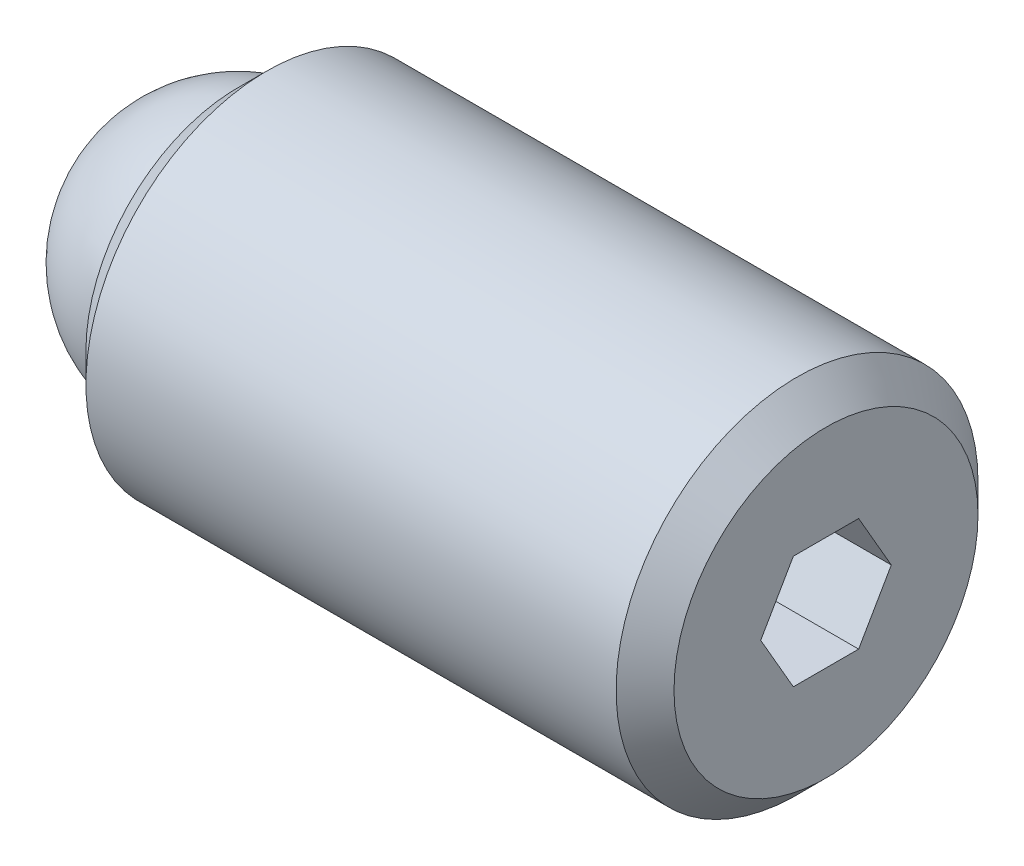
from build123d import *

# Parameters (mm, degrees)
SKETCH2_R           = 3.175
BOSS_EXTRUDE1_DEPTH = 10.31875
CHAMFER1_SIZE       = 0.508
CHAMFER2_SIZE       = 0.508
CUT_EXTRUDE2_DEPTH  = 2.286
SKETCH3_R           = 2.38125
CUT_EXTRUDE3_DEPTH  = 2.38125
CUT_EXTRUDE4_DEPTH  = 2.38125


with BuildPart() as part:
    # Sketch2 → Boss-Extrude1 (new body)
    with BuildSketch(Plane(origin=(0, 0, 0), x_dir=(0, 0, -1), z_dir=(1, 0, 0))):
        Circle(SKETCH2_R)
    extrude(amount=BOSS_EXTRUDE1_DEPTH)

    # Chamfer1
    chamfer1_edges = [part.edges().sort_by_distance(p)[0] for p in [
        (0, 0, 3.175),
    ]]
    chamfer(chamfer1_edges, length=CHAMFER1_SIZE)

    # Chamfer2
    chamfer2_edges = [part.edges().sort_by_distance(p)[0] for p in [
        (10.31875, 0, 3.175),
    ]]
    chamfer(chamfer2_edges, length=CHAMFER2_SIZE)

    # Sketch4 → Cut-Extrude2 (cut)
    with BuildSketch(Plane(origin=(10.31875, 0, 0), x_dir=(0, 0, -1), z_dir=(1, 0, 0))):
        Polygon((1.14567944, 0), (0.57283972, 0.9921875), (-0.57283972, 0.9921875), (-1.14567944, 0), (-0.57283972, -0.9921875), (0.57283972, -0.9921875), align=None)
    extrude(amount=-CUT_EXTRUDE2_DEPTH, mode=Mode.SUBTRACT)

    # Sketch3 → Cut-Extrude3 (cut)
    with BuildSketch(Plane.ZY):
        Circle(SKETCH3_R)
    extrude(amount=-CUT_EXTRUDE3_DEPTH, mode=Mode.SUBTRACT)

    # Sketch7 → Cut-Extrude4 (cut)
    with BuildSketch(Plane.ZY):
        with BuildLine():
            ThreePointArc((0.063494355, 2.380403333), (0, 2.38125), (-0.063494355, 2.380403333))
            ThreePointArc((-0.063494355, 2.380403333), (0, 2.44475), (0.063494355, 2.380403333))
        make_face()
    extrude(amount=-CUT_EXTRUDE4_DEPTH, mode=Mode.SUBTRACT)


with BuildPart() as body_2:
    # Sketch5 → Revolve1 (revolve)
    with BuildSketch(Plane.ZY):
        with BuildLine():
            Line((0, 0), (0, -2.38125))
            ThreePointArc((0, -2.38125), (-2.38125, 0), (0, 2.38125))
            Line((0, 2.38125), (0, 0))
        make_face()
    revolve(axis=Axis((0, 0, 0), (0, 1, 0)))


solid = Compound([part.part, body_2.part])
